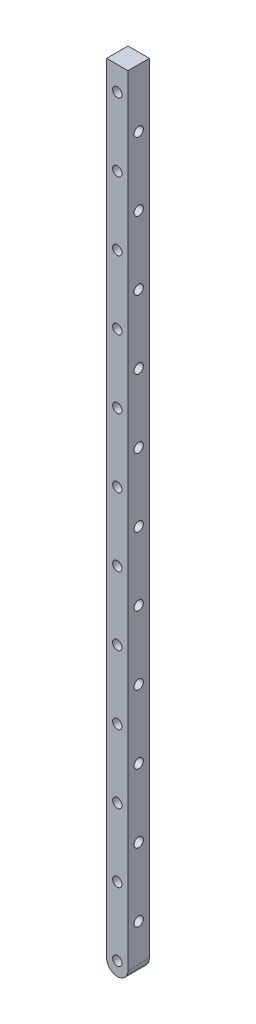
from build123d import *

# Parameters (mm, degrees)
SKETCH1_W             = 7.9375
SKETCH1_H             = 7.9375
BOSS_EXTRUDE1_DEPTH   = 293.37
F_8_32_TAPPED_HOLE1_D = 3.4544
LPATTERN2_COUNT       = 12
LPATTERN2_PITCH       = 25.4
F_8_32_TAPPED_HOLE2_D = 3.4544
LPATTERN3_COUNT       = 11
LPATTERN3_PITCH       = 25.4
FILLET1_RADIUS        = 3.96875
FILLET1_LENGTH        = 7.9375


with BuildPart() as part:
    # Sketch1 → Boss-Extrude1 (new body)
    with BuildSketch(Plane.XZ):
        Rectangle(SKETCH1_W, SKETCH1_H)
    extrude(amount=BOSS_EXTRUDE1_DEPTH)

    # 8-32 Tapped Hole1 (through all)
    with Locations(Plane(origin=(-3.96875, 0, 3.96875), x_dir=(-1, 0, 0), z_dir=(0, 0, 1))):
        with Locations((-3.96875, 8.89)):
            f_8_32_tapped_hole1 = Hole(F_8_32_TAPPED_HOLE1_D / 2)

    # LPattern2: 8-32 Tapped Hole1 ×12
    with Locations(*[(0, -i * LPATTERN2_PITCH, 0) for i in range(1, LPATTERN2_COUNT)]):
        add(f_8_32_tapped_hole1, mode=Mode.SUBTRACT)

    # 8-32 Tapped Hole2 (through all)
    with Locations(Plane(origin=(-3.96875, -300.83125, 0), x_dir=(0, 1, 0), z_dir=(-1, 0, 0))):
        with Locations((279.24125, 0)):
            f_8_32_tapped_hole2 = Hole(F_8_32_TAPPED_HOLE2_D / 2)

    # LPattern3: 8-32 Tapped Hole2 ×11
    with Locations(*[(0, -i * LPATTERN3_PITCH, 0) for i in range(1, LPATTERN3_COUNT)]):
        add(f_8_32_tapped_hole2, mode=Mode.SUBTRACT)

    # Fillet1: full round fillet: the end face becomes a half cylinder, R = half its width
    fillet1_face = Plane((0, -293.37, 0), x_dir=(0, 0, -1), z_dir=(0, -1, 0))  # on the end face: x along it, z out of the body
    fillet1_slab = fillet1_face.offset(-FILLET1_RADIUS / 2) * Box(FILLET1_LENGTH, 2 * FILLET1_RADIUS, FILLET1_RADIUS, mode=Mode.PRIVATE)  # the body's end, R deep
    fillet1_round = Plane((0, -289.40125, 0), x_dir=(0, -1, 0), z_dir=(0, 0, -1)) * Cylinder(FILLET1_RADIUS, FILLET1_LENGTH, mode=Mode.PRIVATE)  # its axis R under the face
    add(fillet1_slab - fillet1_round, mode=Mode.SUBTRACT)


solid = part.part
